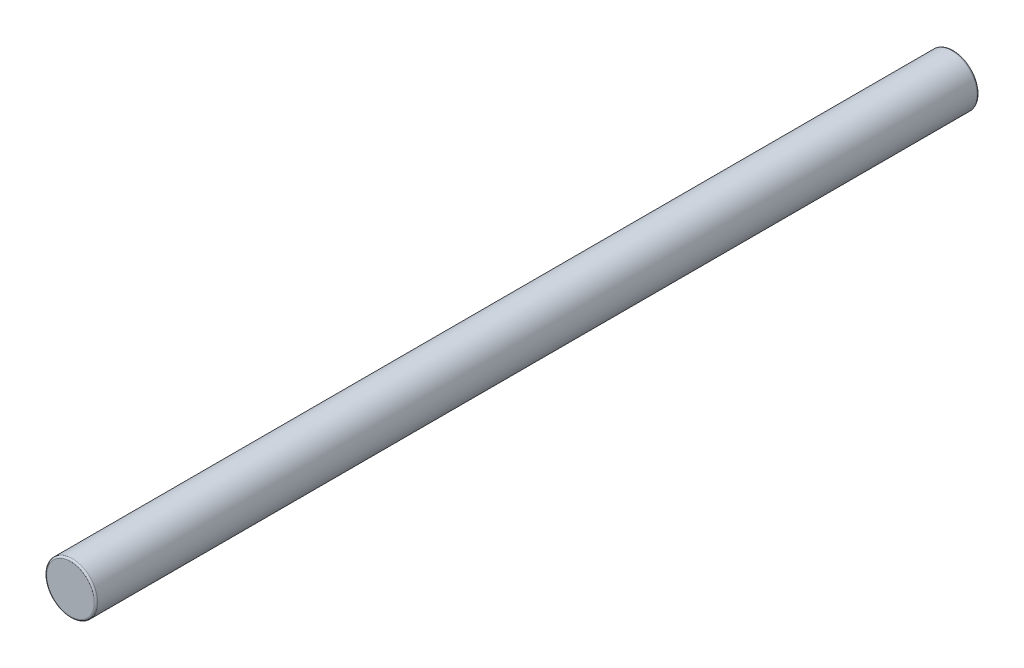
ISO-10303-21;
HEADER;
FILE_DESCRIPTION(('STEP AP214'),'2;1');
FILE_NAME('part.step','',(''),(''),'','','');
FILE_SCHEMA(('AUTOMOTIVE_DESIGN { 1 0 10303 214 1 1 1 1 }'));
ENDSEC;
DATA;
#1=APPLICATION_CONTEXT('core data for automotive mechanical design processes');
#2=APPLICATION_PROTOCOL_DEFINITION('international standard','automotive_design',2000,#1);
#3=PRODUCT_CONTEXT('',#1,'mechanical');
#4=PRODUCT('Part','Part','',(#3));
#5=PRODUCT_RELATED_PRODUCT_CATEGORY('part','',(#4));
#6=PRODUCT_DEFINITION_FORMATION('','',#4);
#7=PRODUCT_DEFINITION_CONTEXT('part definition',#1,'design');
#8=PRODUCT_DEFINITION('design','',#6,#7);
#9=PRODUCT_DEFINITION_SHAPE('','',#8);
#10=(LENGTH_UNIT() NAMED_UNIT(*) SI_UNIT(.MILLI.,.METRE.));
#11=(NAMED_UNIT(*) PLANE_ANGLE_UNIT() SI_UNIT($,.RADIAN.));
#12=(NAMED_UNIT(*) SI_UNIT($,.STERADIAN.) SOLID_ANGLE_UNIT());
#13=UNCERTAINTY_MEASURE_WITH_UNIT(LENGTH_MEASURE(1.E-05),#10,'distance_accuracy_value','');
#14=(GEOMETRIC_REPRESENTATION_CONTEXT(3) GLOBAL_UNCERTAINTY_ASSIGNED_CONTEXT((#13)) GLOBAL_UNIT_ASSIGNED_CONTEXT((#10,
#11,#12)) REPRESENTATION_CONTEXT('',''));
#15=CARTESIAN_POINT('',(0.,0.,0.));
#16=DIRECTION('',(0.,0.,1.));
#17=DIRECTION('',(1.,0.,0.));
#18=AXIS2_PLACEMENT_3D('',#15,#16,#17);
#19=CARTESIAN_POINT('',(0.,0.,52.));
#20=DIRECTION('',(0.,0.,-1.));
#21=DIRECTION('',(-1.,0.,0.));
#22=AXIS2_PLACEMENT_3D('',#19,#20,#21);
#23=CYLINDRICAL_SURFACE('',#22,1.5);
#24=CARTESIAN_POINT('',(0.,0.,51.9));
#25=DIRECTION('',(0.,0.,1.));
#26=DIRECTION('',(1.,0.,0.));
#27=AXIS2_PLACEMENT_3D('',#24,#25,#26);
#28=CIRCLE('',#27,1.5);
#29=CARTESIAN_POINT('',(-1.5,0.,51.9));
#30=VERTEX_POINT('',#29);
#31=EDGE_CURVE('E35',#30,#30,#28,.F.);
#32=CARTESIAN_POINT('',(0.,0.,0.100000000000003));
#33=DIRECTION('',(0.,0.,1.));
#34=DIRECTION('',(1.,0.,0.));
#35=AXIS2_PLACEMENT_3D('',#32,#33,#34);
#36=CIRCLE('',#35,1.5);
#37=CARTESIAN_POINT('',(-1.5,0.,0.100000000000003));
#38=VERTEX_POINT('',#37);
#39=EDGE_CURVE('E39',#38,#38,#36,.T.);
#40=CARTESIAN_POINT('',(-1.5,0.,51.9));
#41=CARTESIAN_POINT('',(-1.5,0.,51.3604166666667));
#42=CARTESIAN_POINT('',(-1.5,0.,50.8208333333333));
#43=CARTESIAN_POINT('',(-1.5,0.,49.7416666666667));
#44=CARTESIAN_POINT('',(-1.5,0.,49.2020833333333));
#45=CARTESIAN_POINT('',(-1.5,0.,48.1229166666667));
#46=CARTESIAN_POINT('',(-1.5,0.,47.5833333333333));
#47=CARTESIAN_POINT('',(-1.5,0.,46.5041666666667));
#48=CARTESIAN_POINT('',(-1.5,0.,45.9645833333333));
#49=CARTESIAN_POINT('',(-1.5,0.,44.8854166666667));
#50=CARTESIAN_POINT('',(-1.5,0.,44.3458333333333));
#51=CARTESIAN_POINT('',(-1.5,0.,43.2666666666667));
#52=CARTESIAN_POINT('',(-1.5,0.,42.7270833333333));
#53=CARTESIAN_POINT('',(-1.5,0.,41.6479166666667));
#54=CARTESIAN_POINT('',(-1.5,0.,41.1083333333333));
#55=CARTESIAN_POINT('',(-1.5,0.,40.0291666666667));
#56=CARTESIAN_POINT('',(-1.5,0.,39.4895833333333));
#57=CARTESIAN_POINT('',(-1.5,0.,38.4104166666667));
#58=CARTESIAN_POINT('',(-1.5,0.,37.8708333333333));
#59=CARTESIAN_POINT('',(-1.5,0.,36.7916666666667));
#60=CARTESIAN_POINT('',(-1.5,0.,36.2520833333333));
#61=CARTESIAN_POINT('',(-1.5,0.,35.1729166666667));
#62=CARTESIAN_POINT('',(-1.5,0.,34.6333333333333));
#63=CARTESIAN_POINT('',(-1.5,0.,33.5541666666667));
#64=CARTESIAN_POINT('',(-1.5,0.,33.0145833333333));
#65=CARTESIAN_POINT('',(-1.5,0.,31.9354166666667));
#66=CARTESIAN_POINT('',(-1.5,0.,31.3958333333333));
#67=CARTESIAN_POINT('',(-1.5,0.,30.3166666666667));
#68=CARTESIAN_POINT('',(-1.5,0.,29.7770833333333));
#69=CARTESIAN_POINT('',(-1.5,0.,28.6979166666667));
#70=CARTESIAN_POINT('',(-1.5,0.,28.1583333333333));
#71=CARTESIAN_POINT('',(-1.5,0.,27.0791666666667));
#72=CARTESIAN_POINT('',(-1.5,0.,26.5395833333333));
#73=CARTESIAN_POINT('',(-1.5,0.,25.4604166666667));
#74=CARTESIAN_POINT('',(-1.5,0.,24.9208333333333));
#75=CARTESIAN_POINT('',(-1.5,0.,23.8416666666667));
#76=CARTESIAN_POINT('',(-1.5,0.,23.3020833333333));
#77=CARTESIAN_POINT('',(-1.5,0.,22.2229166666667));
#78=CARTESIAN_POINT('',(-1.5,0.,21.6833333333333));
#79=CARTESIAN_POINT('',(-1.5,0.,20.6041666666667));
#80=CARTESIAN_POINT('',(-1.5,0.,20.0645833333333));
#81=CARTESIAN_POINT('',(-1.5,0.,18.9854166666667));
#82=CARTESIAN_POINT('',(-1.5,0.,18.4458333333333));
#83=CARTESIAN_POINT('',(-1.5,0.,17.3666666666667));
#84=CARTESIAN_POINT('',(-1.5,0.,16.8270833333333));
#85=CARTESIAN_POINT('',(-1.5,0.,15.7479166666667));
#86=CARTESIAN_POINT('',(-1.5,0.,15.2083333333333));
#87=CARTESIAN_POINT('',(-1.5,0.,14.1291666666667));
#88=CARTESIAN_POINT('',(-1.5,0.,13.5895833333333));
#89=CARTESIAN_POINT('',(-1.5,0.,12.5104166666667));
#90=CARTESIAN_POINT('',(-1.5,0.,11.9708333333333));
#91=CARTESIAN_POINT('',(-1.5,0.,10.8916666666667));
#92=CARTESIAN_POINT('',(-1.5,0.,10.3520833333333));
#93=CARTESIAN_POINT('',(-1.5,0.,9.27291666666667));
#94=CARTESIAN_POINT('',(-1.5,0.,8.73333333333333));
#95=CARTESIAN_POINT('',(-1.5,0.,7.65416666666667));
#96=CARTESIAN_POINT('',(-1.5,0.,7.11458333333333));
#97=CARTESIAN_POINT('',(-1.5,0.,6.03541666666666));
#98=CARTESIAN_POINT('',(-1.5,0.,5.49583333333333));
#99=CARTESIAN_POINT('',(-1.5,0.,4.41666666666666));
#100=CARTESIAN_POINT('',(-1.5,0.,3.87708333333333));
#101=CARTESIAN_POINT('',(-1.5,0.,2.79791666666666));
#102=CARTESIAN_POINT('',(-1.5,0.,2.25833333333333));
#103=CARTESIAN_POINT('',(-1.5,0.,1.17916666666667));
#104=CARTESIAN_POINT('',(-1.5,0.,0.639583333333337));
#105=CARTESIAN_POINT('',(-1.5,0.,0.100000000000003));
#106=B_SPLINE_CURVE_WITH_KNOTS('',3,(#40,#41,#42,#43,#44,#45,#46,#47,#48,#49,#50,#51,#52,#53,
#54,#55,#56,#57,#58,#59,#60,#61,#62,#63,#64,#65,#66,#67,#68,#69,#70,#71,#72,#73,#74,#75,#76,#77,
#78,#79,#80,#81,#82,#83,#84,#85,#86,#87,#88,#89,#90,#91,#92,#93,#94,#95,#96,#97,#98,#99,#100,
#101,#102,#103,#104,#105),.UNSPECIFIED.,.F.,.F.,(4,2,2,2,2,2,2,2,2,2,2,2,2,2,2,2,2,2,2,2,2,2,2,
2,2,2,2,2,2,2,2,2,4),(0.,1.61875,3.2375,4.85625,6.475,8.09375,9.7125,11.33125,12.95,14.56875,
16.1875,17.80625,19.425,21.04375,22.6625,24.28125,25.9,27.51875,29.1375,30.75625,32.375,
33.99375,35.6125,37.23125,38.85,40.46875,42.0875,43.70625,45.325,46.94375,48.5625,50.18125,
51.8),.UNSPECIFIED.);
#107=EDGE_CURVE('BSEAM29',#30,#38,#106,.T.);
#108=ORIENTED_EDGE('',*,*,#31,.T.);
#109=ORIENTED_EDGE('',*,*,#39,.T.);
#110=ORIENTED_EDGE('',*,*,#107,.T.);
#111=ORIENTED_EDGE('',*,*,#107,.F.);
#112=EDGE_LOOP('',(#108,#110,#109,#111));
#113=FACE_BOUND('',#112,.T.);
#114=ADVANCED_FACE('F29',(#113),#23,.T.);
#115=CARTESIAN_POINT('',(0.,0.,52.));
#116=DIRECTION('',(0.,0.,1.));
#117=DIRECTION('',(1.,0.,0.));
#118=AXIS2_PLACEMENT_3D('',#115,#116,#117);
#119=PLANE('',#118);
#120=CARTESIAN_POINT('',(0.,0.,52.));
#121=DIRECTION('',(0.,0.,1.));
#122=DIRECTION('',(1.,0.,0.));
#123=AXIS2_PLACEMENT_3D('',#120,#121,#122);
#124=CIRCLE('',#123,1.4);
#125=CARTESIAN_POINT('',(1.4,0.,52.));
#126=VERTEX_POINT('',#125);
#127=EDGE_CURVE('E43',#126,#126,#124,.T.);
#128=ORIENTED_EDGE('',*,*,#127,.T.);
#129=EDGE_LOOP('',(#128));
#130=FACE_BOUND('',#129,.T.);
#131=ADVANCED_FACE('F49',(#130),#119,.T.);
#132=CARTESIAN_POINT('',(0.,0.,0.));
#133=DIRECTION('',(0.,0.,1.));
#134=DIRECTION('',(1.,0.,0.));
#135=AXIS2_PLACEMENT_3D('',#132,#133,#134);
#136=PLANE('',#135);
#137=CARTESIAN_POINT('',(0.,0.,0.));
#138=DIRECTION('',(0.,0.,1.));
#139=DIRECTION('',(1.,0.,0.));
#140=AXIS2_PLACEMENT_3D('',#137,#138,#139);
#141=CIRCLE('',#140,1.4);
#142=CARTESIAN_POINT('',(1.4,0.,0.));
#143=VERTEX_POINT('',#142);
#144=EDGE_CURVE('E10',#143,#143,#141,.F.);
#145=ORIENTED_EDGE('',*,*,#144,.T.);
#146=EDGE_LOOP('',(#145));
#147=FACE_BOUND('',#146,.T.);
#148=ADVANCED_FACE('F54',(#147),#136,.F.);
#149=CARTESIAN_POINT('',(0.,0.,51.9));
#150=DIRECTION('',(0.,0.,1.));
#151=DIRECTION('',(1.,0.,0.));
#152=AXIS2_PLACEMENT_3D('',#149,#150,#151);
#153=TOROIDAL_SURFACE('',#152,1.4,0.1);
#154=ORIENTED_EDGE('',*,*,#31,.F.);
#155=EDGE_LOOP('',(#154));
#156=FACE_BOUND('',#155,.T.);
#157=ORIENTED_EDGE('',*,*,#127,.F.);
#158=EDGE_LOOP('',(#157));
#159=FACE_BOUND('',#158,.T.);
#160=ADVANCED_FACE('F51',(#156,#159),#153,.T.);
#161=CARTESIAN_POINT('',(0.,0.,0.100000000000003));
#162=DIRECTION('',(0.,0.,1.));
#163=DIRECTION('',(1.,0.,0.));
#164=AXIS2_PLACEMENT_3D('',#161,#162,#163);
#165=TOROIDAL_SURFACE('',#164,1.4,0.1);
#166=ORIENTED_EDGE('',*,*,#144,.F.);
#167=EDGE_LOOP('',(#166));
#168=FACE_BOUND('',#167,.T.);
#169=ORIENTED_EDGE('',*,*,#39,.F.);
#170=EDGE_LOOP('',(#169));
#171=FACE_BOUND('',#170,.T.);
#172=ADVANCED_FACE('F53',(#168,#171),#165,.T.);
#173=CLOSED_SHELL('',(#114,#131,#148,#160,#172));
#174=MANIFOLD_SOLID_BREP('B2',#173);
#175=ADVANCED_BREP_SHAPE_REPRESENTATION('',(#18,#174),#14);
#176=SHAPE_DEFINITION_REPRESENTATION(#9,#175);
ENDSEC;
END-ISO-10303-21;
